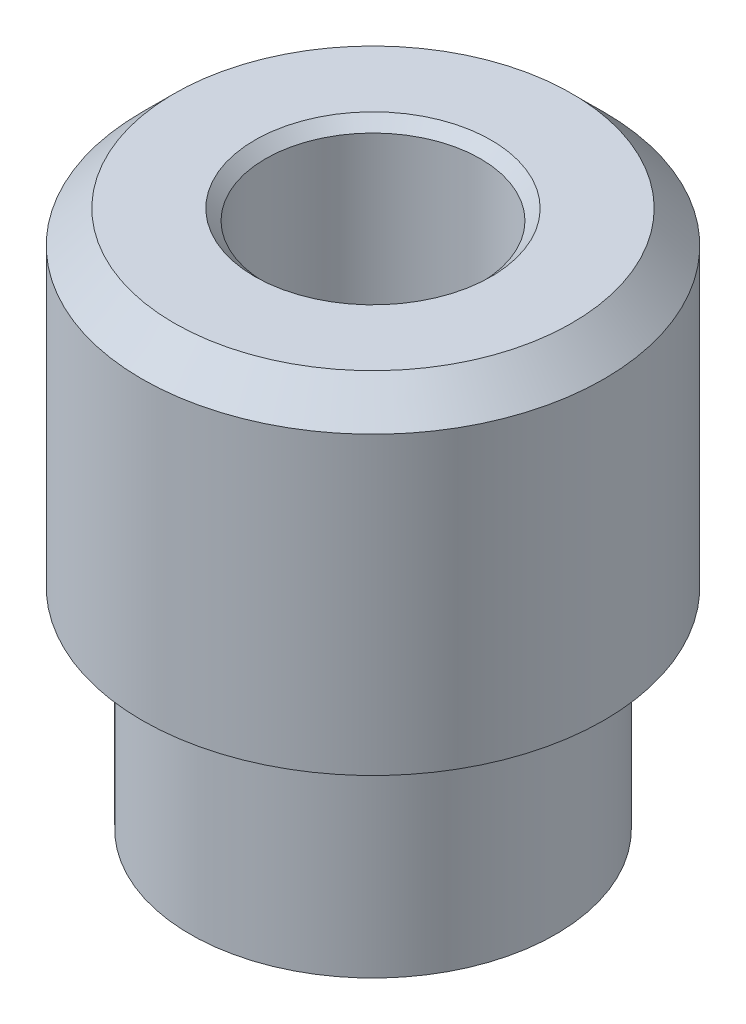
ISO-10303-21;
HEADER;
FILE_DESCRIPTION(('STEP AP214'),'2;1');
FILE_NAME('part.step','',(''),(''),'','','');
FILE_SCHEMA(('AUTOMOTIVE_DESIGN { 1 0 10303 214 1 1 1 1 }'));
ENDSEC;
DATA;
#1=APPLICATION_CONTEXT('core data for automotive mechanical design processes');
#2=APPLICATION_PROTOCOL_DEFINITION('international standard','automotive_design',2000,#1);
#3=PRODUCT_CONTEXT('',#1,'mechanical');
#4=PRODUCT('Part','Part','',(#3));
#5=PRODUCT_RELATED_PRODUCT_CATEGORY('part','',(#4));
#6=PRODUCT_DEFINITION_FORMATION('','',#4);
#7=PRODUCT_DEFINITION_CONTEXT('part definition',#1,'design');
#8=PRODUCT_DEFINITION('design','',#6,#7);
#9=PRODUCT_DEFINITION_SHAPE('','',#8);
#10=(LENGTH_UNIT() NAMED_UNIT(*) SI_UNIT(.MILLI.,.METRE.));
#11=(NAMED_UNIT(*) PLANE_ANGLE_UNIT() SI_UNIT($,.RADIAN.));
#12=(NAMED_UNIT(*) SI_UNIT($,.STERADIAN.) SOLID_ANGLE_UNIT());
#13=UNCERTAINTY_MEASURE_WITH_UNIT(LENGTH_MEASURE(1.E-05),#10,'distance_accuracy_value','');
#14=(GEOMETRIC_REPRESENTATION_CONTEXT(3) GLOBAL_UNCERTAINTY_ASSIGNED_CONTEXT((#13)) GLOBAL_UNIT_ASSIGNED_CONTEXT((#10,
#11,#12)) REPRESENTATION_CONTEXT('',''));
#15=CARTESIAN_POINT('',(0.,0.,0.));
#16=DIRECTION('',(0.,0.,1.));
#17=DIRECTION('',(1.,0.,0.));
#18=AXIS2_PLACEMENT_3D('',#15,#16,#17);
#19=CARTESIAN_POINT('',(0.,25.,0.));
#20=DIRECTION('',(0.,-1.,0.));
#21=DIRECTION('',(0.,0.,-1.));
#22=AXIS2_PLACEMENT_3D('',#19,#20,#21);
#23=CYLINDRICAL_SURFACE('',#22,10.75);
#24=CARTESIAN_POINT('',(0.,23.5,0.));
#25=DIRECTION('',(0.,1.,0.));
#26=DIRECTION('',(0.,0.,1.));
#27=AXIS2_PLACEMENT_3D('',#24,#25,#26);
#28=CIRCLE('',#27,10.75);
#29=CARTESIAN_POINT('',(0.,23.5,10.75));
#30=VERTEX_POINT('',#29);
#31=EDGE_CURVE('E11',#30,#30,#28,.F.);
#32=ORIENTED_EDGE('',*,*,#31,.T.);
#33=EDGE_LOOP('',(#32));
#34=FACE_BOUND('',#33,.T.);
#35=CARTESIAN_POINT('',(0.,9.75,0.));
#36=DIRECTION('',(0.,-1.,0.));
#37=DIRECTION('',(0.,0.,-1.));
#38=AXIS2_PLACEMENT_3D('',#35,#36,#37);
#39=CIRCLE('',#38,10.75);
#40=CARTESIAN_POINT('',(0.,9.75,-10.75));
#41=VERTEX_POINT('',#40);
#42=EDGE_CURVE('E60',#41,#41,#39,.F.);
#43=ORIENTED_EDGE('',*,*,#42,.T.);
#44=EDGE_LOOP('',(#43));
#45=FACE_BOUND('',#44,.T.);
#46=ADVANCED_FACE('F34',(#34,#45),#23,.T.);
#47=CARTESIAN_POINT('',(0.,25.,0.));
#48=DIRECTION('',(0.,1.,0.));
#49=DIRECTION('',(0.,0.,1.));
#50=AXIS2_PLACEMENT_3D('',#47,#48,#49);
#51=PLANE('',#50);
#52=CARTESIAN_POINT('',(0.,25.,0.));
#53=DIRECTION('',(0.,1.,0.));
#54=DIRECTION('',(0.,0.,1.));
#55=AXIS2_PLACEMENT_3D('',#52,#53,#54);
#56=CIRCLE('',#55,9.24999999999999);
#57=CARTESIAN_POINT('',(0.,25.,9.24999999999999));
#58=VERTEX_POINT('',#57);
#59=EDGE_CURVE('E41',#58,#58,#56,.T.);
#60=ORIENTED_EDGE('',*,*,#59,.T.);
#61=EDGE_LOOP('',(#60));
#62=FACE_BOUND('',#61,.T.);
#63=CARTESIAN_POINT('',(0.,25.,0.));
#64=DIRECTION('',(0.,1.,0.));
#65=DIRECTION('',(0.,0.,1.));
#66=AXIS2_PLACEMENT_3D('',#63,#64,#65);
#67=CIRCLE('',#66,5.5);
#68=CARTESIAN_POINT('',(0.,25.,5.5));
#69=VERTEX_POINT('',#68);
#70=EDGE_CURVE('E49',#69,#69,#67,.F.);
#71=ORIENTED_EDGE('',*,*,#70,.T.);
#72=EDGE_LOOP('',(#71));
#73=FACE_BOUND('',#72,.T.);
#74=ADVANCED_FACE('F81',(#62,#73),#51,.T.);
#75=CARTESIAN_POINT('',(0.,8.5,0.));
#76=DIRECTION('',(0.,-1.,0.));
#77=DIRECTION('',(0.,0.,-1.));
#78=AXIS2_PLACEMENT_3D('',#75,#76,#77);
#79=CYLINDRICAL_SURFACE('',#78,8.5);
#80=CARTESIAN_POINT('',(0.,8.20579832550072,0.));
#81=DIRECTION('',(0.,-1.,0.));
#82=DIRECTION('',(0.,0.,-1.));
#83=AXIS2_PLACEMENT_3D('',#80,#81,#82);
#84=CIRCLE('',#83,8.5);
#85=CARTESIAN_POINT('',(0.,8.20579832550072,-8.5));
#86=VERTEX_POINT('',#85);
#87=EDGE_CURVE('E57',#86,#86,#84,.T.);
#88=ORIENTED_EDGE('',*,*,#87,.T.);
#89=EDGE_LOOP('',(#88));
#90=FACE_BOUND('',#89,.T.);
#91=CARTESIAN_POINT('',(0.,0.,0.));
#92=DIRECTION('',(0.,-1.,0.));
#93=DIRECTION('',(0.,0.,-1.));
#94=AXIS2_PLACEMENT_3D('',#91,#92,#93);
#95=CIRCLE('',#94,8.5);
#96=CARTESIAN_POINT('',(0.,0.,-8.5));
#97=VERTEX_POINT('',#96);
#98=EDGE_CURVE('E63',#97,#97,#95,.T.);
#99=ORIENTED_EDGE('',*,*,#98,.F.);
#100=EDGE_LOOP('',(#99));
#101=FACE_BOUND('',#100,.T.);
#102=ADVANCED_FACE('F76',(#90,#101),#79,.T.);
#103=CARTESIAN_POINT('',(0.,0.,0.));
#104=DIRECTION('',(0.,1.,0.));
#105=DIRECTION('',(0.,0.,1.));
#106=AXIS2_PLACEMENT_3D('',#103,#104,#105);
#107=PLANE('',#106);
#108=CARTESIAN_POINT('',(0.,0.,0.));
#109=DIRECTION('',(0.,-1.,0.));
#110=DIRECTION('',(0.,0.,-1.));
#111=AXIS2_PLACEMENT_3D('',#108,#109,#110);
#112=CIRCLE('',#111,5.);
#113=CARTESIAN_POINT('',(0.,0.,-5.));
#114=VERTEX_POINT('',#113);
#115=EDGE_CURVE('E66',#114,#114,#112,.T.);
#116=ORIENTED_EDGE('',*,*,#115,.F.);
#117=EDGE_LOOP('',(#116));
#118=FACE_BOUND('',#117,.T.);
#119=ORIENTED_EDGE('',*,*,#98,.T.);
#120=EDGE_LOOP('',(#119));
#121=FACE_BOUND('',#120,.T.);
#122=ADVANCED_FACE('F72',(#118,#121),#107,.F.);
#123=CARTESIAN_POINT('',(0.,8.5,0.));
#124=DIRECTION('',(0.,1.,0.));
#125=DIRECTION('',(0.,0.,1.));
#126=AXIS2_PLACEMENT_3D('',#123,#124,#125);
#127=CONICAL_SURFACE('',#126,8.5,1.06369782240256);
#128=CARTESIAN_POINT('',(0.,8.64287696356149,0.));
#129=DIRECTION('',(0.,1.,0.));
#130=DIRECTION('',(0.,0.,1.));
#131=AXIS2_PLACEMENT_3D('',#128,#129,#130);
#132=CIRCLE('',#131,8.75717853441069);
#133=CARTESIAN_POINT('',(0.,8.64287696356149,8.75717853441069));
#134=VERTEX_POINT('',#133);
#135=EDGE_CURVE('E54',#134,#134,#132,.T.);
#136=ORIENTED_EDGE('',*,*,#135,.T.);
#137=EDGE_LOOP('',(#136));
#138=FACE_BOUND('',#137,.T.);
#139=ORIENTED_EDGE('',*,*,#42,.F.);
#140=EDGE_LOOP('',(#139));
#141=FACE_BOUND('',#140,.T.);
#142=ADVANCED_FACE('F75',(#138,#141),#127,.T.);
#143=CARTESIAN_POINT('',(0.,8.20579832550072,0.));
#144=DIRECTION('',(0.,-1.,0.));
#145=DIRECTION('',(0.,0.,-1.));
#146=AXIS2_PLACEMENT_3D('',#143,#144,#145);
#147=TOROIDAL_SURFACE('',#146,9.,0.5);
#148=ORIENTED_EDGE('',*,*,#135,.F.);
#149=EDGE_LOOP('',(#148));
#150=FACE_BOUND('',#149,.T.);
#151=ORIENTED_EDGE('',*,*,#87,.F.);
#152=EDGE_LOOP('',(#151));
#153=FACE_BOUND('',#152,.T.);
#154=ADVANCED_FACE('F97',(#150,#153),#147,.F.);
#155=CARTESIAN_POINT('',(0.,25.,0.));
#156=DIRECTION('',(0.,-1.,0.));
#157=DIRECTION('',(0.,0.,-1.));
#158=AXIS2_PLACEMENT_3D('',#155,#156,#157);
#159=CYLINDRICAL_SURFACE('',#158,5.);
#160=CARTESIAN_POINT('',(0.,24.5,0.));
#161=DIRECTION('',(0.,1.,0.));
#162=DIRECTION('',(0.,0.,1.));
#163=AXIS2_PLACEMENT_3D('',#160,#161,#162);
#164=CIRCLE('',#163,5.);
#165=CARTESIAN_POINT('',(0.,24.5,5.));
#166=VERTEX_POINT('',#165);
#167=EDGE_CURVE('E45',#166,#166,#164,.T.);
#168=ORIENTED_EDGE('',*,*,#167,.T.);
#169=EDGE_LOOP('',(#168));
#170=FACE_BOUND('',#169,.T.);
#171=ORIENTED_EDGE('',*,*,#115,.T.);
#172=EDGE_LOOP('',(#171));
#173=FACE_BOUND('',#172,.T.);
#174=ADVANCED_FACE('F70',(#170,#173),#159,.F.);
#175=CARTESIAN_POINT('',(0.,25.,0.));
#176=DIRECTION('',(0.,1.,0.));
#177=DIRECTION('',(0.,0.,1.));
#178=AXIS2_PLACEMENT_3D('',#175,#176,#177);
#179=CONICAL_SURFACE('',#178,5.5,0.785398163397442);
#180=ORIENTED_EDGE('',*,*,#167,.F.);
#181=EDGE_LOOP('',(#180));
#182=FACE_BOUND('',#181,.T.);
#183=ORIENTED_EDGE('',*,*,#70,.F.);
#184=EDGE_LOOP('',(#183));
#185=FACE_BOUND('',#184,.T.);
#186=ADVANCED_FACE('F101',(#182,#185),#179,.F.);
#187=CARTESIAN_POINT('',(0.,25.,0.));
#188=DIRECTION('',(0.,-1.,0.));
#189=DIRECTION('',(0.,0.,-1.));
#190=AXIS2_PLACEMENT_3D('',#187,#188,#189);
#191=CONICAL_SURFACE('',#190,9.24999999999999,0.78539816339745);
#192=ORIENTED_EDGE('',*,*,#31,.F.);
#193=EDGE_LOOP('',(#192));
#194=FACE_BOUND('',#193,.T.);
#195=ORIENTED_EDGE('',*,*,#59,.F.);
#196=EDGE_LOOP('',(#195));
#197=FACE_BOUND('',#196,.T.);
#198=ADVANCED_FACE('F36',(#194,#197),#191,.T.);
#199=CLOSED_SHELL('',(#46,#74,#102,#122,#142,#154,#174,#186,#198));
#200=MANIFOLD_SOLID_BREP('B2',#199);
#201=ADVANCED_BREP_SHAPE_REPRESENTATION('',(#18,#200),#14);
#202=SHAPE_DEFINITION_REPRESENTATION(#9,#201);
ENDSEC;
END-ISO-10303-21;
